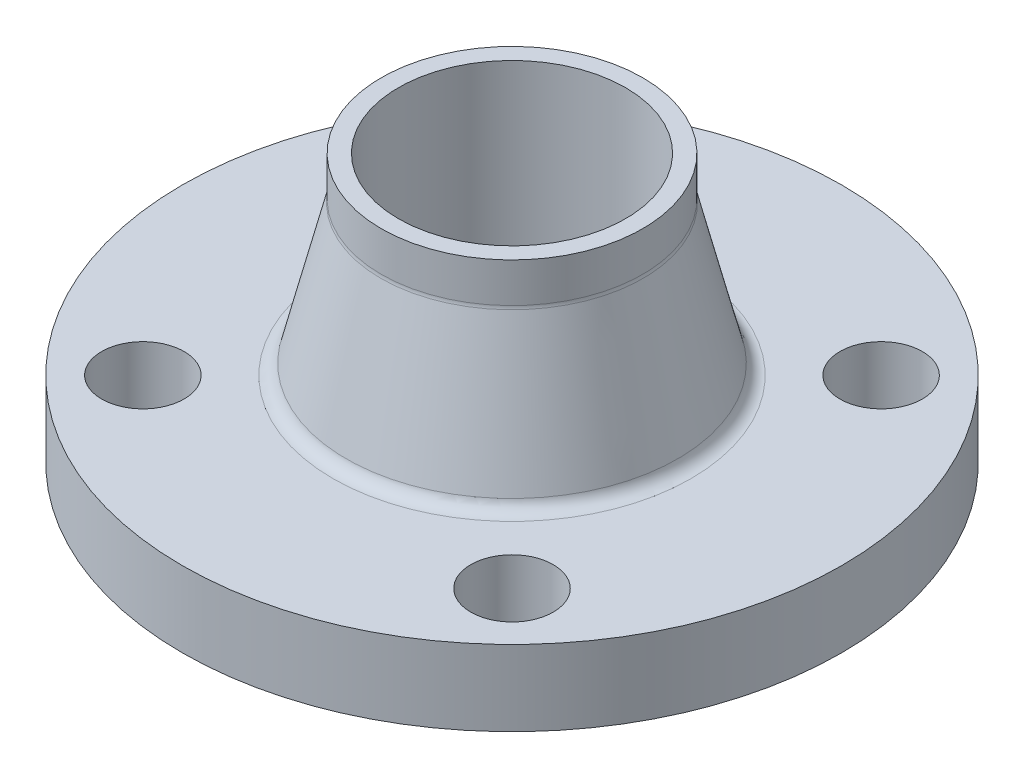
from build123d import *

# Parameters (mm, degrees)
SKETCH4_R               = 9.525
F_1ST_BOLT_HOLE_DEPTH   = 117.570504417
BOLT_HOLE_PATTERN_COUNT = 4


with BuildPart() as part:
    # Sketch3 → Base-Revolve (revolve)
    with BuildSketch(Plane.XY, mode=Mode.PRIVATE) as base_revolve_sk:
        with BuildLine():
            Line((26.2509, 61.9125), (26.2509, -1.5875))
            Line((26.2509, -1.5875), (46.0375, -1.5875))
            Line((46.0375, -1.5875), (46.0375, 0))
            Line((46.0375, 0), (76.2, 0))
            Line((76.2, 0), (76.2, 17.4625))
            Line((76.2, 17.4625), (41.377092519, 17.4625))
            ThreePointArc((41.377092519, 17.4625), (39.421017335, 18.13662118), (38.295576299, 19.872723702))
            Line((38.295576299, 19.872723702), (30.31948378, 52.010825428))
            ThreePointArc((30.31948378, 52.010825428), (30.2494576, 52.390367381), (30.226, 52.775601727))
            Line((30.226, 52.775601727), (30.226, 61.9125))
            Line((30.226, 61.9125), (26.2509, 61.9125))
        make_face()
    revolve(base_revolve_sk.sketch.rotate(Axis((0, 0, 0), (0, 1, 0)), 90), axis=Axis((0, 0, 0), (0, 1, 0)))

    # Sketch4 → 1st Bolt Hole (cut, through all)
    with BuildSketch(Plane(origin=(0, 17.4625, 0), x_dir=(-1, 0, 0), z_dir=(0, 1, 0))):
        with Locations(Location((-42.656216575, 42.656216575, 0), (0, 0, 90))):
            Circle(SKETCH4_R)
    f_1st_bolt_hole = extrude(amount=-F_1ST_BOLT_HOLE_DEPTH, mode=Mode.SUBTRACT)

    # Bolt Hole Pattern: 1st Bolt Hole ×4 about axis
    bolt_hole_pattern_axis = Axis((0, 0, 0), (0, 1, 0))
    for i in range(1, BOLT_HOLE_PATTERN_COUNT):
        add(f_1st_bolt_hole.rotate(bolt_hole_pattern_axis, i * 360 / BOLT_HOLE_PATTERN_COUNT), mode=Mode.SUBTRACT)


solid = part.part
